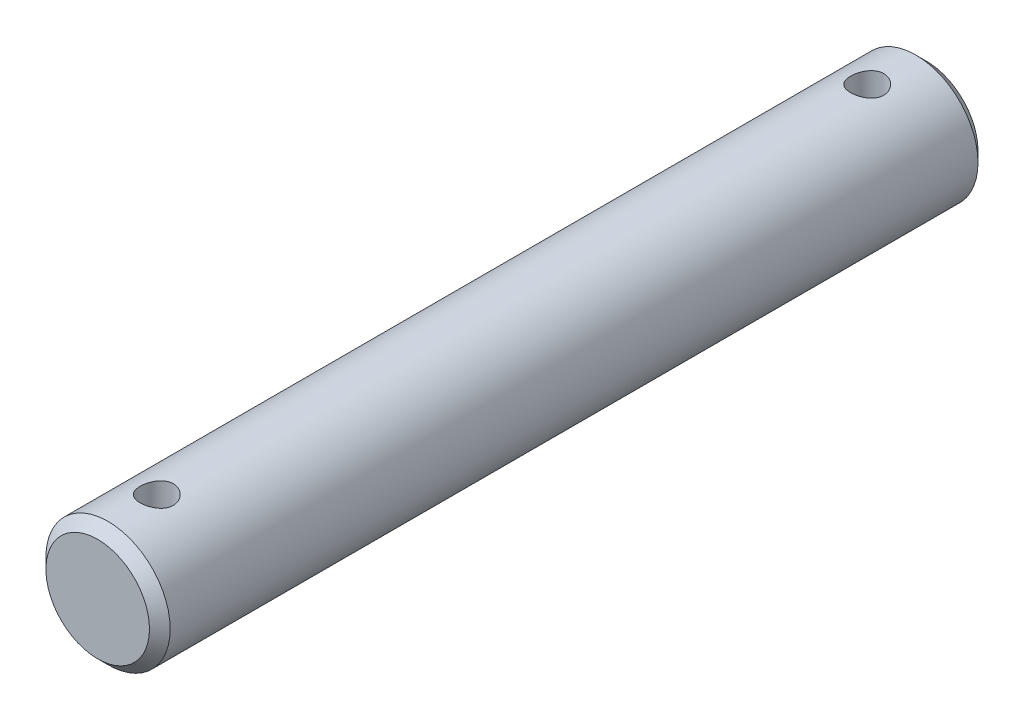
ISO-10303-21;
HEADER;
FILE_DESCRIPTION(('STEP AP214'),'2;1');
FILE_NAME('part.step','',(''),(''),'','','');
FILE_SCHEMA(('AUTOMOTIVE_DESIGN { 1 0 10303 214 1 1 1 1 }'));
ENDSEC;
DATA;
#1=APPLICATION_CONTEXT('core data for automotive mechanical design processes');
#2=APPLICATION_PROTOCOL_DEFINITION('international standard','automotive_design',2000,#1);
#3=PRODUCT_CONTEXT('',#1,'mechanical');
#4=PRODUCT('Part','Part','',(#3));
#5=PRODUCT_RELATED_PRODUCT_CATEGORY('part','',(#4));
#6=PRODUCT_DEFINITION_FORMATION('','',#4);
#7=PRODUCT_DEFINITION_CONTEXT('part definition',#1,'design');
#8=PRODUCT_DEFINITION('design','',#6,#7);
#9=PRODUCT_DEFINITION_SHAPE('','',#8);
#10=(LENGTH_UNIT() NAMED_UNIT(*) SI_UNIT(.MILLI.,.METRE.));
#11=(NAMED_UNIT(*) PLANE_ANGLE_UNIT() SI_UNIT($,.RADIAN.));
#12=(NAMED_UNIT(*) SI_UNIT($,.STERADIAN.) SOLID_ANGLE_UNIT());
#13=UNCERTAINTY_MEASURE_WITH_UNIT(LENGTH_MEASURE(1.E-05),#10,'distance_accuracy_value','');
#14=(GEOMETRIC_REPRESENTATION_CONTEXT(3) GLOBAL_UNCERTAINTY_ASSIGNED_CONTEXT((#13)) GLOBAL_UNIT_ASSIGNED_CONTEXT((#10,
#11,#12)) REPRESENTATION_CONTEXT('',''));
#15=CARTESIAN_POINT('',(0.,0.,0.));
#16=DIRECTION('',(0.,0.,1.));
#17=DIRECTION('',(1.,0.,0.));
#18=AXIS2_PLACEMENT_3D('',#15,#16,#17);
#19=CARTESIAN_POINT('',(0.,0.,20.));
#20=DIRECTION('',(0.,0.,-1.));
#21=DIRECTION('',(-1.,0.,0.));
#22=AXIS2_PLACEMENT_3D('',#19,#20,#21);
#23=CYLINDRICAL_SURFACE('',#22,3.);
#24=CARTESIAN_POINT('',(0.,-3.,17.95));
#25=CARTESIAN_POINT('',(0.0441018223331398,-2.9999993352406,17.9499989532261));
#26=CARTESIAN_POINT('',(0.0882148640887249,-2.99901794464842,17.9463409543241));
#27=CARTESIAN_POINT('',(0.175170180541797,-2.99519829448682,17.9318315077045));
#28=CARTESIAN_POINT('',(0.218011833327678,-2.99235914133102,17.9209765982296));
#29=CARTESIAN_POINT('',(0.301156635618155,-2.98513733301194,17.8924513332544));
#30=CARTESIAN_POINT('',(0.341462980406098,-2.98075666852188,17.8747897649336));
#31=CARTESIAN_POINT('',(0.418541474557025,-2.97091479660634,17.8331851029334));
#32=CARTESIAN_POINT('',(0.455313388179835,-2.96545351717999,17.8092415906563));
#33=CARTESIAN_POINT('',(0.525131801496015,-2.95389845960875,17.7551665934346));
#34=CARTESIAN_POINT('',(0.558084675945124,-2.94779387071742,17.7249165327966));
#35=CARTESIAN_POINT('',(0.61851485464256,-2.93570963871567,17.6593406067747));
#36=CARTESIAN_POINT('',(0.645991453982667,-2.92973001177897,17.6240140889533));
#37=CARTESIAN_POINT('',(0.69514563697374,-2.91846214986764,17.5485407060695));
#38=CARTESIAN_POINT('',(0.716715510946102,-2.91318755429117,17.5083214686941));
#39=CARTESIAN_POINT('',(0.75275019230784,-2.90408590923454,17.4246639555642));
#40=CARTESIAN_POINT('',(0.767216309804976,-2.9002585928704,17.3812262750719));
#41=CARTESIAN_POINT('',(0.788307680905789,-2.89459646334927,17.2934017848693));
#42=CARTESIAN_POINT('',(0.795102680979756,-2.89271859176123,17.2490585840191));
#43=CARTESIAN_POINT('',(0.801188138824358,-2.89103932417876,17.1598249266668));
#44=CARTESIAN_POINT('',(0.800479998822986,-2.89123754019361,17.1149345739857));
#45=CARTESIAN_POINT('',(0.791714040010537,-2.89364951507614,17.027205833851));
#46=CARTESIAN_POINT('',(0.783861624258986,-2.89580694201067,16.9843451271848));
#47=CARTESIAN_POINT('',(0.761358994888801,-2.90180405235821,16.9005726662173));
#48=CARTESIAN_POINT('',(0.746708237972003,-2.90564387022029,16.8596610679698));
#49=CARTESIAN_POINT('',(0.710857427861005,-2.91462264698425,16.7804127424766));
#50=CARTESIAN_POINT('',(0.689585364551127,-2.91977577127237,16.7421102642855));
#51=CARTESIAN_POINT('',(0.641146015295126,-2.93079291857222,16.6695463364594));
#52=CARTESIAN_POINT('',(0.613977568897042,-2.93665708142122,16.6352856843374));
#53=CARTESIAN_POINT('',(0.553466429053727,-2.94867004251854,16.5706044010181));
#54=CARTESIAN_POINT('',(0.519951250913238,-2.95482188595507,16.540345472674));
#55=CARTESIAN_POINT('',(0.448247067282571,-2.9665455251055,16.4858444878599));
#56=CARTESIAN_POINT('',(0.410057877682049,-2.97211729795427,16.461602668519));
#57=CARTESIAN_POINT('',(0.329839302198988,-2.98208728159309,16.4197528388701));
#58=CARTESIAN_POINT('',(0.287793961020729,-2.98648029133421,16.4021740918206));
#59=CARTESIAN_POINT('',(0.201200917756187,-2.99356017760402,16.3743811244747));
#60=CARTESIAN_POINT('',(0.156653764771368,-2.99624742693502,16.3641652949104));
#61=CARTESIAN_POINT('',(0.0677016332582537,-2.99955663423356,16.3516420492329));
#62=CARTESIAN_POINT('',(0.0233296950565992,-3.00023598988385,16.3491147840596));
#63=CARTESIAN_POINT('',(-0.0652040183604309,-2.99961788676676,16.3514332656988));
#64=CARTESIAN_POINT('',(-0.109365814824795,-2.99832063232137,16.3562782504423));
#65=CARTESIAN_POINT('',(-0.195440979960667,-2.99393214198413,16.373023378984));
#66=CARTESIAN_POINT('',(-0.237379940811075,-2.99087210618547,16.3848008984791));
#67=CARTESIAN_POINT('',(-0.318682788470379,-2.98330517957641,16.4149343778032));
#68=CARTESIAN_POINT('',(-0.358046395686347,-2.97879813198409,16.4332910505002));
#69=CARTESIAN_POINT('',(-0.43393538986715,-2.96870264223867,16.4764695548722));
#70=CARTESIAN_POINT('',(-0.470390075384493,-2.96309474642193,16.5014109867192));
#71=CARTESIAN_POINT('',(-0.53867385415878,-2.95144580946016,16.556900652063));
#72=CARTESIAN_POINT('',(-0.570502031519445,-2.94540468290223,16.5874499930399));
#73=CARTESIAN_POINT('',(-0.62955569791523,-2.93335898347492,16.6543142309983));
#74=CARTESIAN_POINT('',(-0.656626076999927,-2.92736024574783,16.69076742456));
#75=CARTESIAN_POINT('',(-0.704268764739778,-2.91626578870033,16.7678258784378));
#76=CARTESIAN_POINT('',(-0.724841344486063,-2.91117003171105,16.8084309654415));
#77=CARTESIAN_POINT('',(-0.758749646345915,-2.90251707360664,16.8924381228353));
#78=CARTESIAN_POINT('',(-0.772127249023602,-2.89895099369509,16.9358223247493));
#79=CARTESIAN_POINT('',(-0.791364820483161,-2.8937593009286,17.0243357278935));
#80=CARTESIAN_POINT('',(-0.797226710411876,-2.8921331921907,17.0694644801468));
#81=CARTESIAN_POINT('',(-0.801155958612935,-2.89104697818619,17.158597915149));
#82=CARTESIAN_POINT('',(-0.799472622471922,-2.89151759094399,17.2025909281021));
#83=CARTESIAN_POINT('',(-0.788937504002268,-2.89440958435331,17.2896414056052));
#84=CARTESIAN_POINT('',(-0.78008590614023,-2.89683091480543,17.3326988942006));
#85=CARTESIAN_POINT('',(-0.755610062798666,-2.903310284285,17.4163423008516));
#86=CARTESIAN_POINT('',(-0.740038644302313,-2.90735554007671,17.4569447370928));
#87=CARTESIAN_POINT('',(-0.702606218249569,-2.91662727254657,17.5349915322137));
#88=CARTESIAN_POINT('',(-0.680744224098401,-2.92185393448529,17.5724353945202));
#89=CARTESIAN_POINT('',(-0.630595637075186,-2.93309168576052,17.6442921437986));
#90=CARTESIAN_POINT('',(-0.602138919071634,-2.93912133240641,17.6785834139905));
#91=CARTESIAN_POINT('',(-0.539932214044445,-2.95118201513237,17.7419849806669));
#92=CARTESIAN_POINT('',(-0.506180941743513,-2.95721305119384,17.7710940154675));
#93=CARTESIAN_POINT('',(-0.43347199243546,-2.96875124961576,17.8239168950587));
#94=CARTESIAN_POINT('',(-0.394418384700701,-2.97424444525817,17.8475020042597));
#95=CARTESIAN_POINT('',(-0.312755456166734,-2.98393524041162,17.8877349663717));
#96=CARTESIAN_POINT('',(-0.270148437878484,-2.98813367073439,17.9043872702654));
#97=CARTESIAN_POINT('',(-0.189749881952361,-2.99421901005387,17.9281101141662));
#98=CARTESIAN_POINT('',(-0.15230480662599,-2.9963710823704,17.936299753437));
#99=CARTESIAN_POINT('',(-0.07657591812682,-2.99926179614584,17.9472448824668));
#100=CARTESIAN_POINT('',(-0.0382921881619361,-3.00000057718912,17.95000090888));
#101=CARTESIAN_POINT('',(0.,-3.,17.95));
#102=B_SPLINE_CURVE_WITH_KNOTS('',3,(#24,#25,#26,#27,#28,#29,#30,#31,#32,#33,#34,#35,#36,#37,
#38,#39,#40,#41,#42,#43,#44,#45,#46,#47,#48,#49,#50,#51,#52,#53,#54,#55,#56,#57,#58,#59,#60,#61,
#62,#63,#64,#65,#66,#67,#68,#69,#70,#71,#72,#73,#74,#75,#76,#77,#78,#79,#80,#81,#82,#83,#84,#85,
#86,#87,#88,#89,#90,#91,#92,#93,#94,#95,#96,#97,#98,#99,#100,#101),.UNSPECIFIED.,.T.,.F.,(4,2,2,
2,2,2,2,2,2,2,2,2,2,2,2,2,2,2,2,2,2,2,2,2,2,2,2,2,2,2,2,2,2,2,2,2,2,2,4),(0.,0.132165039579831,
0.264393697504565,0.396452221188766,0.528519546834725,0.663339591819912,0.79817697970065,
0.935330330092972,1.07245837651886,1.20648863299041,1.34049384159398,1.4707640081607,
1.6010445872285,1.73279469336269,1.86457075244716,2.00064503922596,2.1367246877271,
2.27339523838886,2.41003590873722,2.54273087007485,2.67541211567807,2.80581414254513,
2.93623030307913,3.06920114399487,3.20219827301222,3.33894598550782,3.47568799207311,
3.611625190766,3.74752763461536,3.87897336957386,4.0104157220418,4.14084306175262,
4.27129086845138,4.40557735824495,4.53989649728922,4.67708900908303,4.81419330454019,
4.92895927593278,5.04371391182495),.UNSPECIFIED.);
#103=CARTESIAN_POINT('',(0.,-3.,17.95));
#104=VERTEX_POINT('',#103);
#105=EDGE_CURVE('E10',#104,#104,#102,.T.);
#106=ORIENTED_EDGE('',*,*,#105,.T.);
#107=EDGE_LOOP('',(#106));
#108=FACE_BOUND('',#107,.T.);
#109=CARTESIAN_POINT('',(0.,3.00000000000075,17.95));
#110=CARTESIAN_POINT('',(-0.0441018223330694,2.99999933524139,17.9499989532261));
#111=CARTESIAN_POINT('',(-0.0882148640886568,2.99901794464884,17.9463409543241));
#112=CARTESIAN_POINT('',(-0.175170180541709,2.99519829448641,17.9318315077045));
#113=CARTESIAN_POINT('',(-0.218011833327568,2.99235914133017,17.9209765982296));
#114=CARTESIAN_POINT('',(-0.301156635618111,2.98513733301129,17.8924513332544));
#115=CARTESIAN_POINT('',(-0.341462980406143,2.98075666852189,17.8747897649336));
#116=CARTESIAN_POINT('',(-0.418541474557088,2.97091479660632,17.8331851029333));
#117=CARTESIAN_POINT('',(-0.455313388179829,2.96545351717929,17.8092415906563));
#118=CARTESIAN_POINT('',(-0.525131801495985,2.95389845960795,17.7551665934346));
#119=CARTESIAN_POINT('',(-0.558084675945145,2.9477938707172,17.7249165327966));
#120=CARTESIAN_POINT('',(-0.618514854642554,2.93570963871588,17.6593406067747));
#121=CARTESIAN_POINT('',(-0.645991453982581,2.92973001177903,17.6240140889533));
#122=CARTESIAN_POINT('',(-0.695145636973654,2.91846214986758,17.5485407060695));
#123=CARTESIAN_POINT('',(-0.716715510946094,2.91318755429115,17.5083214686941));
#124=CARTESIAN_POINT('',(-0.752750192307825,2.90408590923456,17.4246639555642));
#125=CARTESIAN_POINT('',(-0.767216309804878,2.9002585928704,17.3812262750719));
#126=CARTESIAN_POINT('',(-0.788307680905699,2.89459646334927,17.2934017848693));
#127=CARTESIAN_POINT('',(-0.795102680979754,2.89271859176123,17.2490585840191));
#128=CARTESIAN_POINT('',(-0.801188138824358,2.89103932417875,17.1598249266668));
#129=CARTESIAN_POINT('',(-0.800479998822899,2.89123754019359,17.1149345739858));
#130=CARTESIAN_POINT('',(-0.791714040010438,2.89364951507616,17.027205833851));
#131=CARTESIAN_POINT('',(-0.78386162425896,2.89580694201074,16.9843451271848));
#132=CARTESIAN_POINT('',(-0.761358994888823,2.90180405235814,16.9005726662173));
#133=CARTESIAN_POINT('',(-0.746708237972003,2.90564387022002,16.8596610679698));
#134=CARTESIAN_POINT('',(-0.710857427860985,2.91462264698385,16.7804127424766));
#135=CARTESIAN_POINT('',(-0.689585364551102,2.91977577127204,16.7421102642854));
#136=CARTESIAN_POINT('',(-0.641146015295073,2.93079291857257,16.6695463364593));
#137=CARTESIAN_POINT('',(-0.613977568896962,2.93665708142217,16.6352856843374));
#138=CARTESIAN_POINT('',(-0.553466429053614,2.94867004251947,16.5706044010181));
#139=CARTESIAN_POINT('',(-0.519951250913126,2.95482188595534,16.540345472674));
#140=CARTESIAN_POINT('',(-0.448247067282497,2.96654552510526,16.4858444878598));
#141=CARTESIAN_POINT('',(-0.41005787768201,2.9721172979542,16.461602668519));
#142=CARTESIAN_POINT('',(-0.329839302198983,2.98208728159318,16.4197528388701));
#143=CARTESIAN_POINT('',(-0.287793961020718,2.98648029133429,16.4021740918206));
#144=CARTESIAN_POINT('',(-0.201200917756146,2.99356017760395,16.3743811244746));
#145=CARTESIAN_POINT('',(-0.156653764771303,2.9962474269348,16.3641652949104));
#146=CARTESIAN_POINT('',(-0.0677016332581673,2.99955663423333,16.3516420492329));
#147=CARTESIAN_POINT('',(-0.0233296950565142,3.00023598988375,16.3491147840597));
#148=CARTESIAN_POINT('',(0.0652040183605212,2.99961788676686,16.3514332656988));
#149=CARTESIAN_POINT('',(0.109365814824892,2.99832063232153,16.3562782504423));
#150=CARTESIAN_POINT('',(0.195440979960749,2.99393214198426,16.373023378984));
#151=CARTESIAN_POINT('',(0.237379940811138,2.99087210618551,16.3848008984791));
#152=CARTESIAN_POINT('',(0.318682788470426,2.98330517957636,16.4149343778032));
#153=CARTESIAN_POINT('',(0.3580463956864,2.97879813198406,16.4332910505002));
#154=CARTESIAN_POINT('',(0.433935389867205,2.9687026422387,16.4764695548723));
#155=CARTESIAN_POINT('',(0.470390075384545,2.96309474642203,16.5014109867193));
#156=CARTESIAN_POINT('',(0.538673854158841,2.95144580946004,16.5569006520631));
#157=CARTESIAN_POINT('',(0.570502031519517,2.94540468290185,16.5874499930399));
#158=CARTESIAN_POINT('',(0.629555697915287,2.93335898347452,16.6543142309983));
#159=CARTESIAN_POINT('',(0.656626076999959,2.92736024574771,16.6907674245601));
#160=CARTESIAN_POINT('',(0.704268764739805,2.91626578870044,16.7678258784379));
#161=CARTESIAN_POINT('',(0.724841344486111,2.91117003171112,16.8084309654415));
#162=CARTESIAN_POINT('',(0.758749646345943,2.90251707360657,16.8924381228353));
#163=CARTESIAN_POINT('',(0.772127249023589,2.89895099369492,16.9358223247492));
#164=CARTESIAN_POINT('',(0.791364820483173,2.89375930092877,17.0243357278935));
#165=CARTESIAN_POINT('',(0.797226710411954,2.8921331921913,17.0694644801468));
#166=CARTESIAN_POINT('',(0.801155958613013,2.89104697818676,17.158597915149));
#167=CARTESIAN_POINT('',(0.79947262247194,2.89151759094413,17.2025909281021));
#168=CARTESIAN_POINT('',(0.788937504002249,2.89440958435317,17.2896414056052));
#169=CARTESIAN_POINT('',(0.780085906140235,2.89683091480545,17.3326988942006));
#170=CARTESIAN_POINT('',(0.755610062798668,2.90331028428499,17.4163423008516));
#171=CARTESIAN_POINT('',(0.740038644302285,2.90735554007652,17.4569447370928));
#172=CARTESIAN_POINT('',(0.702606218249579,2.91662727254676,17.5349915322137));
#173=CARTESIAN_POINT('',(0.680744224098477,2.92185393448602,17.5724353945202));
#174=CARTESIAN_POINT('',(0.630595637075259,2.93309168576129,17.6442921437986));
#175=CARTESIAN_POINT('',(0.602138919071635,2.93912133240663,17.6785834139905));
#176=CARTESIAN_POINT('',(0.539932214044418,2.95118201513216,17.7419849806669));
#177=CARTESIAN_POINT('',(0.506180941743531,2.95721305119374,17.7710940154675));
#178=CARTESIAN_POINT('',(0.433471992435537,2.96875124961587,17.8239168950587));
#179=CARTESIAN_POINT('',(0.39441838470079,2.97424444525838,17.8475020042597));
#180=CARTESIAN_POINT('',(0.312755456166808,2.9839352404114,17.8877349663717));
#181=CARTESIAN_POINT('',(0.270148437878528,2.98813367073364,17.9043872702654));
#182=CARTESIAN_POINT('',(0.189749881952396,2.99421901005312,17.9281101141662));
#183=CARTESIAN_POINT('',(0.152304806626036,2.99637108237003,17.936299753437));
#184=CARTESIAN_POINT('',(0.0765759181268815,2.9992617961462,17.9472448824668));
#185=CARTESIAN_POINT('',(0.0382921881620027,3.00000057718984,17.95000090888));
#186=CARTESIAN_POINT('',(0.,3.00000000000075,17.95));
#187=B_SPLINE_CURVE_WITH_KNOTS('',3,(#109,#110,#111,#112,#113,#114,#115,#116,#117,#118,#119,
#120,#121,#122,#123,#124,#125,#126,#127,#128,#129,#130,#131,#132,#133,#134,#135,#136,#137,#138,
#139,#140,#141,#142,#143,#144,#145,#146,#147,#148,#149,#150,#151,#152,#153,#154,#155,#156,#157,
#158,#159,#160,#161,#162,#163,#164,#165,#166,#167,#168,#169,#170,#171,#172,#173,#174,#175,#176,
#177,#178,#179,#180,#181,#182,#183,#184,#185,#186),.UNSPECIFIED.,.T.,.F.,(4,2,2,2,2,2,2,2,2,2,2,
2,2,2,2,2,2,2,2,2,2,2,2,2,2,2,2,2,2,2,2,2,2,2,2,2,2,2,4),(0.,0.132165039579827,
0.264393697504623,0.39645222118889,0.528519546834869,0.663339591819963,0.798176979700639,
0.935330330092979,1.07245837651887,1.20648863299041,1.340493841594,1.47076400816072,
1.60104458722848,1.73279469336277,1.86457075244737,2.00064503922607,2.13672468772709,
2.27339523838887,2.41003590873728,2.54273087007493,2.67541211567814,2.80581414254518,
2.93623030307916,3.06920114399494,3.20219827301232,3.33894598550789,3.47568799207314,
3.61162519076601,3.74752763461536,3.87897336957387,4.0104157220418,4.14084306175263,
4.27129086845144,4.40557735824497,4.53989649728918,4.67708900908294,4.81419330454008,
4.92895927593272,5.04371391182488),.UNSPECIFIED.);
#188=CARTESIAN_POINT('',(0.,3.00000000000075,17.95));
#189=VERTEX_POINT('',#188);
#190=EDGE_CURVE('E41',#189,#189,#187,.T.);
#191=ORIENTED_EDGE('',*,*,#190,.T.);
#192=EDGE_LOOP('',(#191));
#193=FACE_BOUND('',#192,.T.);
#194=CARTESIAN_POINT('',(0.,-3.,-16.35));
#195=CARTESIAN_POINT('',(0.0441018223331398,-2.9999993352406,-16.3500010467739));
#196=CARTESIAN_POINT('',(0.0882148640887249,-2.99901794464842,-16.3536590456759));
#197=CARTESIAN_POINT('',(0.175170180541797,-2.99519829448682,-16.3681684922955));
#198=CARTESIAN_POINT('',(0.218011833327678,-2.99235914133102,-16.3790234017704));
#199=CARTESIAN_POINT('',(0.301156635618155,-2.98513733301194,-16.4075486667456));
#200=CARTESIAN_POINT('',(0.341462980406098,-2.98075666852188,-16.4252102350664));
#201=CARTESIAN_POINT('',(0.418541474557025,-2.97091479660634,-16.4668148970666));
#202=CARTESIAN_POINT('',(0.455313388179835,-2.96545351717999,-16.4907584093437));
#203=CARTESIAN_POINT('',(0.525131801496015,-2.95389845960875,-16.5448334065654));
#204=CARTESIAN_POINT('',(0.558084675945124,-2.94779387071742,-16.5750834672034));
#205=CARTESIAN_POINT('',(0.61851485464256,-2.93570963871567,-16.6406593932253));
#206=CARTESIAN_POINT('',(0.645991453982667,-2.92973001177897,-16.6759859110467));
#207=CARTESIAN_POINT('',(0.69514563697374,-2.91846214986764,-16.7514592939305));
#208=CARTESIAN_POINT('',(0.716715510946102,-2.91318755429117,-16.7916785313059));
#209=CARTESIAN_POINT('',(0.75275019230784,-2.90408590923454,-16.8753360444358));
#210=CARTESIAN_POINT('',(0.767216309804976,-2.9002585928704,-16.9187737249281));
#211=CARTESIAN_POINT('',(0.788307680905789,-2.89459646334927,-17.0065982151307));
#212=CARTESIAN_POINT('',(0.795102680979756,-2.89271859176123,-17.0509414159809));
#213=CARTESIAN_POINT('',(0.801188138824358,-2.89103932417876,-17.1401750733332));
#214=CARTESIAN_POINT('',(0.800479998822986,-2.89123754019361,-17.1850654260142));
#215=CARTESIAN_POINT('',(0.791714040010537,-2.89364951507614,-17.2727941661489));
#216=CARTESIAN_POINT('',(0.783861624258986,-2.89580694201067,-17.3156548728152));
#217=CARTESIAN_POINT('',(0.761358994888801,-2.90180405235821,-17.3994273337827));
#218=CARTESIAN_POINT('',(0.746708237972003,-2.90564387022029,-17.4403389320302));
#219=CARTESIAN_POINT('',(0.710857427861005,-2.91462264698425,-17.5195872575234));
#220=CARTESIAN_POINT('',(0.689585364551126,-2.91977577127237,-17.5578897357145));
#221=CARTESIAN_POINT('',(0.641146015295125,-2.93079291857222,-17.6304536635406));
#222=CARTESIAN_POINT('',(0.613977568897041,-2.93665708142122,-17.6647143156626));
#223=CARTESIAN_POINT('',(0.553466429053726,-2.94867004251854,-17.7293955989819));
#224=CARTESIAN_POINT('',(0.519951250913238,-2.95482188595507,-17.759654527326));
#225=CARTESIAN_POINT('',(0.448247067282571,-2.9665455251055,-17.8141555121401));
#226=CARTESIAN_POINT('',(0.410057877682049,-2.97211729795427,-17.838397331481));
#227=CARTESIAN_POINT('',(0.329839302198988,-2.98208728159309,-17.8802471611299));
#228=CARTESIAN_POINT('',(0.287793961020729,-2.98648029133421,-17.8978259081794));
#229=CARTESIAN_POINT('',(0.201200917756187,-2.99356017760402,-17.9256188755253));
#230=CARTESIAN_POINT('',(0.156653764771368,-2.99624742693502,-17.9358347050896));
#231=CARTESIAN_POINT('',(0.0677016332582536,-2.99955663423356,-17.9483579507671));
#232=CARTESIAN_POINT('',(0.0233296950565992,-3.00023598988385,-17.9508852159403));
#233=CARTESIAN_POINT('',(-0.0652040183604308,-2.99961788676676,-17.9485667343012));
#234=CARTESIAN_POINT('',(-0.109365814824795,-2.99832063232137,-17.9437217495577));
#235=CARTESIAN_POINT('',(-0.195440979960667,-2.99393214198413,-17.926976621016));
#236=CARTESIAN_POINT('',(-0.237379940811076,-2.99087210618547,-17.9151991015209));
#237=CARTESIAN_POINT('',(-0.31868278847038,-2.98330517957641,-17.8850656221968));
#238=CARTESIAN_POINT('',(-0.358046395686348,-2.97879813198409,-17.8667089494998));
#239=CARTESIAN_POINT('',(-0.43393538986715,-2.96870264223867,-17.8235304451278));
#240=CARTESIAN_POINT('',(-0.470390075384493,-2.96309474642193,-17.7985890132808));
#241=CARTESIAN_POINT('',(-0.53867385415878,-2.95144580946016,-17.743099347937));
#242=CARTESIAN_POINT('',(-0.570502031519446,-2.94540468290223,-17.7125500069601));
#243=CARTESIAN_POINT('',(-0.629555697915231,-2.93335898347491,-17.6456857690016));
#244=CARTESIAN_POINT('',(-0.656626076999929,-2.92736024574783,-17.60923257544));
#245=CARTESIAN_POINT('',(-0.70426876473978,-2.91626578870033,-17.5321741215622));
#246=CARTESIAN_POINT('',(-0.724841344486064,-2.91117003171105,-17.4915690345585));
#247=CARTESIAN_POINT('',(-0.758749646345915,-2.90251707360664,-17.4075618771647));
#248=CARTESIAN_POINT('',(-0.772127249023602,-2.89895099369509,-17.3641776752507));
#249=CARTESIAN_POINT('',(-0.791364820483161,-2.8937593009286,-17.2756642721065));
#250=CARTESIAN_POINT('',(-0.797226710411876,-2.8921331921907,-17.2305355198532));
#251=CARTESIAN_POINT('',(-0.801155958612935,-2.89104697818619,-17.141402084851));
#252=CARTESIAN_POINT('',(-0.799472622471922,-2.89151759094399,-17.0974090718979));
#253=CARTESIAN_POINT('',(-0.788937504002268,-2.89440958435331,-17.0103585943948));
#254=CARTESIAN_POINT('',(-0.78008590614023,-2.89683091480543,-16.9673011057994));
#255=CARTESIAN_POINT('',(-0.755610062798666,-2.903310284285,-16.8836576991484));
#256=CARTESIAN_POINT('',(-0.740038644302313,-2.90735554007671,-16.8430552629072));
#257=CARTESIAN_POINT('',(-0.702606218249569,-2.91662727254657,-16.7650084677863));
#258=CARTESIAN_POINT('',(-0.680744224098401,-2.92185393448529,-16.7275646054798));
#259=CARTESIAN_POINT('',(-0.630595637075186,-2.93309168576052,-16.6557078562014));
#260=CARTESIAN_POINT('',(-0.602138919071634,-2.93912133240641,-16.6214165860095));
#261=CARTESIAN_POINT('',(-0.539932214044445,-2.95118201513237,-16.5580150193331));
#262=CARTESIAN_POINT('',(-0.506180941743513,-2.95721305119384,-16.5289059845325));
#263=CARTESIAN_POINT('',(-0.43347199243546,-2.96875124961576,-16.4760831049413));
#264=CARTESIAN_POINT('',(-0.394418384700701,-2.97424444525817,-16.4524979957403));
#265=CARTESIAN_POINT('',(-0.312755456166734,-2.98393524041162,-16.4122650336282));
#266=CARTESIAN_POINT('',(-0.270148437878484,-2.98813367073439,-16.3956127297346));
#267=CARTESIAN_POINT('',(-0.189749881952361,-2.99421901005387,-16.3718898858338));
#268=CARTESIAN_POINT('',(-0.15230480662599,-2.9963710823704,-16.363700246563));
#269=CARTESIAN_POINT('',(-0.07657591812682,-2.99926179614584,-16.3527551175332));
#270=CARTESIAN_POINT('',(-0.0382921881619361,-3.00000057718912,-16.34999909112));
#271=CARTESIAN_POINT('',(0.,-3.,-16.35));
#272=B_SPLINE_CURVE_WITH_KNOTS('',3,(#194,#195,#196,#197,#198,#199,#200,#201,#202,#203,#204,
#205,#206,#207,#208,#209,#210,#211,#212,#213,#214,#215,#216,#217,#218,#219,#220,#221,#222,#223,
#224,#225,#226,#227,#228,#229,#230,#231,#232,#233,#234,#235,#236,#237,#238,#239,#240,#241,#242,
#243,#244,#245,#246,#247,#248,#249,#250,#251,#252,#253,#254,#255,#256,#257,#258,#259,#260,#261,
#262,#263,#264,#265,#266,#267,#268,#269,#270,#271),.UNSPECIFIED.,.T.,.F.,(4,2,2,2,2,2,2,2,2,2,2,
2,2,2,2,2,2,2,2,2,2,2,2,2,2,2,2,2,2,2,2,2,2,2,2,2,2,2,4),(0.,0.132165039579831,
0.264393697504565,0.396452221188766,0.528519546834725,0.663339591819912,0.79817697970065,
0.935330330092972,1.07245837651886,1.20648863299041,1.34049384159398,1.4707640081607,
1.6010445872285,1.7327946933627,1.86457075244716,2.00064503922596,2.1367246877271,
2.27339523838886,2.41003590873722,2.54273087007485,2.67541211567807,2.80581414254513,
2.93623030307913,3.06920114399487,3.20219827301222,3.33894598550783,3.47568799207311,
3.611625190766,3.74752763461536,3.87897336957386,4.0104157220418,4.14084306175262,
4.27129086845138,4.40557735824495,4.53989649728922,4.67708900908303,4.81419330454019,
4.92895927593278,5.04371391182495),.UNSPECIFIED.);
#273=CARTESIAN_POINT('',(0.,-3.,-16.35));
#274=VERTEX_POINT('',#273);
#275=EDGE_CURVE('E45',#274,#274,#272,.T.);
#276=ORIENTED_EDGE('',*,*,#275,.T.);
#277=EDGE_LOOP('',(#276));
#278=FACE_BOUND('',#277,.T.);
#279=CARTESIAN_POINT('',(0.,3.00000000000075,-16.35));
#280=CARTESIAN_POINT('',(-0.0441018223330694,2.99999933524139,-16.3500010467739));
#281=CARTESIAN_POINT('',(-0.0882148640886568,2.99901794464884,-16.3536590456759));
#282=CARTESIAN_POINT('',(-0.175170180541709,2.99519829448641,-16.3681684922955));
#283=CARTESIAN_POINT('',(-0.218011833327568,2.99235914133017,-16.3790234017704));
#284=CARTESIAN_POINT('',(-0.301156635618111,2.98513733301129,-16.4075486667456));
#285=CARTESIAN_POINT('',(-0.341462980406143,2.98075666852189,-16.4252102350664));
#286=CARTESIAN_POINT('',(-0.418541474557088,2.97091479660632,-16.4668148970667));
#287=CARTESIAN_POINT('',(-0.455313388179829,2.96545351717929,-16.4907584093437));
#288=CARTESIAN_POINT('',(-0.525131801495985,2.95389845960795,-16.5448334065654));
#289=CARTESIAN_POINT('',(-0.558084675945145,2.9477938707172,-16.5750834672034));
#290=CARTESIAN_POINT('',(-0.618514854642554,2.93570963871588,-16.6406593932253));
#291=CARTESIAN_POINT('',(-0.645991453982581,2.92973001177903,-16.6759859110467));
#292=CARTESIAN_POINT('',(-0.695145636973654,2.91846214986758,-16.7514592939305));
#293=CARTESIAN_POINT('',(-0.716715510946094,2.91318755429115,-16.7916785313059));
#294=CARTESIAN_POINT('',(-0.752750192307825,2.90408590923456,-16.8753360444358));
#295=CARTESIAN_POINT('',(-0.767216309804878,2.9002585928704,-16.9187737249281));
#296=CARTESIAN_POINT('',(-0.788307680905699,2.89459646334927,-17.0065982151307));
#297=CARTESIAN_POINT('',(-0.795102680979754,2.89271859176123,-17.0509414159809));
#298=CARTESIAN_POINT('',(-0.801188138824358,2.89103932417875,-17.1401750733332));
#299=CARTESIAN_POINT('',(-0.800479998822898,2.89123754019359,-17.1850654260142));
#300=CARTESIAN_POINT('',(-0.791714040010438,2.89364951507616,-17.2727941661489));
#301=CARTESIAN_POINT('',(-0.78386162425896,2.89580694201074,-17.3156548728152));
#302=CARTESIAN_POINT('',(-0.761358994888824,2.90180405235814,-17.3994273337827));
#303=CARTESIAN_POINT('',(-0.746708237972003,2.90564387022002,-17.4403389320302));
#304=CARTESIAN_POINT('',(-0.710857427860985,2.91462264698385,-17.5195872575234));
#305=CARTESIAN_POINT('',(-0.689585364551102,2.91977577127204,-17.5578897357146));
#306=CARTESIAN_POINT('',(-0.641146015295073,2.93079291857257,-17.6304536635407));
#307=CARTESIAN_POINT('',(-0.613977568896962,2.93665708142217,-17.6647143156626));
#308=CARTESIAN_POINT('',(-0.553466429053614,2.94867004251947,-17.7293955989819));
#309=CARTESIAN_POINT('',(-0.519951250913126,2.95482188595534,-17.759654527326));
#310=CARTESIAN_POINT('',(-0.448247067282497,2.96654552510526,-17.8141555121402));
#311=CARTESIAN_POINT('',(-0.41005787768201,2.9721172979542,-17.838397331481));
#312=CARTESIAN_POINT('',(-0.329839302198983,2.98208728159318,-17.8802471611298));
#313=CARTESIAN_POINT('',(-0.287793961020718,2.98648029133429,-17.8978259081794));
#314=CARTESIAN_POINT('',(-0.201200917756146,2.99356017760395,-17.9256188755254));
#315=CARTESIAN_POINT('',(-0.156653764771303,2.9962474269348,-17.9358347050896));
#316=CARTESIAN_POINT('',(-0.0677016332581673,2.99955663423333,-17.9483579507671));
#317=CARTESIAN_POINT('',(-0.0233296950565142,3.00023598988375,-17.9508852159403));
#318=CARTESIAN_POINT('',(0.0652040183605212,2.99961788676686,-17.9485667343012));
#319=CARTESIAN_POINT('',(0.109365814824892,2.99832063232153,-17.9437217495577));
#320=CARTESIAN_POINT('',(0.195440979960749,2.99393214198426,-17.926976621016));
#321=CARTESIAN_POINT('',(0.237379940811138,2.99087210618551,-17.9151991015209));
#322=CARTESIAN_POINT('',(0.318682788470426,2.98330517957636,-17.8850656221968));
#323=CARTESIAN_POINT('',(0.3580463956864,2.97879813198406,-17.8667089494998));
#324=CARTESIAN_POINT('',(0.433935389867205,2.9687026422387,-17.8235304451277));
#325=CARTESIAN_POINT('',(0.470390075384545,2.96309474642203,-17.7985890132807));
#326=CARTESIAN_POINT('',(0.538673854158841,2.95144580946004,-17.7430993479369));
#327=CARTESIAN_POINT('',(0.570502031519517,2.94540468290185,-17.7125500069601));
#328=CARTESIAN_POINT('',(0.629555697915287,2.93335898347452,-17.6456857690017));
#329=CARTESIAN_POINT('',(0.656626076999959,2.92736024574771,-17.6092325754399));
#330=CARTESIAN_POINT('',(0.704268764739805,2.91626578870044,-17.5321741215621));
#331=CARTESIAN_POINT('',(0.724841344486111,2.91117003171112,-17.4915690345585));
#332=CARTESIAN_POINT('',(0.758749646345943,2.90251707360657,-17.4075618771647));
#333=CARTESIAN_POINT('',(0.772127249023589,2.89895099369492,-17.3641776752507));
#334=CARTESIAN_POINT('',(0.791364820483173,2.89375930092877,-17.2756642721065));
#335=CARTESIAN_POINT('',(0.797226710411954,2.8921331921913,-17.2305355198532));
#336=CARTESIAN_POINT('',(0.801155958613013,2.89104697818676,-17.141402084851));
#337=CARTESIAN_POINT('',(0.79947262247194,2.89151759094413,-17.0974090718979));
#338=CARTESIAN_POINT('',(0.788937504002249,2.89440958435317,-17.0103585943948));
#339=CARTESIAN_POINT('',(0.780085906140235,2.89683091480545,-16.9673011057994));
#340=CARTESIAN_POINT('',(0.755610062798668,2.90331028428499,-16.8836576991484));
#341=CARTESIAN_POINT('',(0.740038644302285,2.90735554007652,-16.8430552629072));
#342=CARTESIAN_POINT('',(0.702606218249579,2.91662727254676,-16.7650084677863));
#343=CARTESIAN_POINT('',(0.680744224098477,2.92185393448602,-16.7275646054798));
#344=CARTESIAN_POINT('',(0.630595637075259,2.93309168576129,-16.6557078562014));
#345=CARTESIAN_POINT('',(0.602138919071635,2.93912133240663,-16.6214165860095));
#346=CARTESIAN_POINT('',(0.539932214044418,2.95118201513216,-16.5580150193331));
#347=CARTESIAN_POINT('',(0.506180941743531,2.95721305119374,-16.5289059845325));
#348=CARTESIAN_POINT('',(0.433471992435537,2.96875124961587,-16.4760831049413));
#349=CARTESIAN_POINT('',(0.39441838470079,2.97424444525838,-16.4524979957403));
#350=CARTESIAN_POINT('',(0.312755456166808,2.9839352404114,-16.4122650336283));
#351=CARTESIAN_POINT('',(0.270148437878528,2.98813367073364,-16.3956127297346));
#352=CARTESIAN_POINT('',(0.189749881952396,2.99421901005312,-16.3718898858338));
#353=CARTESIAN_POINT('',(0.152304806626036,2.99637108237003,-16.363700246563));
#354=CARTESIAN_POINT('',(0.0765759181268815,2.9992617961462,-16.3527551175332));
#355=CARTESIAN_POINT('',(0.0382921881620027,3.00000057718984,-16.34999909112));
#356=CARTESIAN_POINT('',(0.,3.00000000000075,-16.35));
#357=B_SPLINE_CURVE_WITH_KNOTS('',3,(#279,#280,#281,#282,#283,#284,#285,#286,#287,#288,#289,
#290,#291,#292,#293,#294,#295,#296,#297,#298,#299,#300,#301,#302,#303,#304,#305,#306,#307,#308,
#309,#310,#311,#312,#313,#314,#315,#316,#317,#318,#319,#320,#321,#322,#323,#324,#325,#326,#327,
#328,#329,#330,#331,#332,#333,#334,#335,#336,#337,#338,#339,#340,#341,#342,#343,#344,#345,#346,
#347,#348,#349,#350,#351,#352,#353,#354,#355,#356),.UNSPECIFIED.,.T.,.F.,(4,2,2,2,2,2,2,2,2,2,2,
2,2,2,2,2,2,2,2,2,2,2,2,2,2,2,2,2,2,2,2,2,2,2,2,2,2,2,4),(0.,0.132165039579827,
0.264393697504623,0.39645222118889,0.528519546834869,0.663339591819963,0.798176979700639,
0.935330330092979,1.07245837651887,1.20648863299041,1.340493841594,1.47076400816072,
1.60104458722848,1.73279469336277,1.86457075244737,2.00064503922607,2.13672468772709,
2.27339523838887,2.41003590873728,2.54273087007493,2.67541211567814,2.80581414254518,
2.93623030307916,3.06920114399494,3.20219827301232,3.33894598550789,3.47568799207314,
3.61162519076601,3.74752763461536,3.87897336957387,4.0104157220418,4.14084306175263,
4.27129086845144,4.40557735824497,4.53989649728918,4.67708900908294,4.81419330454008,
4.92895927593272,5.04371391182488),.UNSPECIFIED.);
#358=CARTESIAN_POINT('',(0.,3.00000000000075,-16.35));
#359=VERTEX_POINT('',#358);
#360=EDGE_CURVE('E49',#359,#359,#357,.T.);
#361=ORIENTED_EDGE('',*,*,#360,.T.);
#362=EDGE_LOOP('',(#361));
#363=FACE_BOUND('',#362,.T.);
#364=CARTESIAN_POINT('',(0.,0.,-19.5));
#365=DIRECTION('',(0.,0.,1.));
#366=DIRECTION('',(1.,0.,0.));
#367=AXIS2_PLACEMENT_3D('',#364,#365,#366);
#368=CIRCLE('',#367,3.);
#369=CARTESIAN_POINT('',(3.00000000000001,0.,-19.5));
#370=VERTEX_POINT('',#369);
#371=EDGE_CURVE('E81',#370,#370,#368,.T.);
#372=ORIENTED_EDGE('',*,*,#371,.T.);
#373=EDGE_LOOP('',(#372));
#374=FACE_BOUND('',#373,.T.);
#375=CARTESIAN_POINT('',(0.,0.,19.5));
#376=DIRECTION('',(0.,0.,1.));
#377=DIRECTION('',(1.,0.,0.));
#378=AXIS2_PLACEMENT_3D('',#375,#376,#377);
#379=CIRCLE('',#378,3.);
#380=CARTESIAN_POINT('',(3.00000000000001,0.,19.5));
#381=VERTEX_POINT('',#380);
#382=EDGE_CURVE('E84',#381,#381,#379,.F.);
#383=ORIENTED_EDGE('',*,*,#382,.T.);
#384=EDGE_LOOP('',(#383));
#385=FACE_BOUND('',#384,.T.);
#386=ADVANCED_FACE('F30',(#108,#193,#278,#363,#374,#385),#23,.T.);
#387=CARTESIAN_POINT('',(0.,0.,20.));
#388=DIRECTION('',(0.,0.,1.));
#389=DIRECTION('',(1.,0.,0.));
#390=AXIS2_PLACEMENT_3D('',#387,#388,#389);
#391=PLANE('',#390);
#392=CARTESIAN_POINT('',(0.,0.,20.));
#393=DIRECTION('',(0.,0.,1.));
#394=DIRECTION('',(1.,0.,0.));
#395=AXIS2_PLACEMENT_3D('',#392,#393,#394);
#396=CIRCLE('',#395,2.5);
#397=CARTESIAN_POINT('',(2.50000000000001,0.,20.));
#398=VERTEX_POINT('',#397);
#399=EDGE_CURVE('E75',#398,#398,#396,.T.);
#400=ORIENTED_EDGE('',*,*,#399,.T.);
#401=EDGE_LOOP('',(#400));
#402=FACE_BOUND('',#401,.T.);
#403=ADVANCED_FACE('F69',(#402),#391,.T.);
#404=CARTESIAN_POINT('',(0.,0.,-20.));
#405=DIRECTION('',(0.,0.,1.));
#406=DIRECTION('',(1.,0.,0.));
#407=AXIS2_PLACEMENT_3D('',#404,#405,#406);
#408=PLANE('',#407);
#409=CARTESIAN_POINT('',(0.,0.,-20.));
#410=DIRECTION('',(0.,0.,1.));
#411=DIRECTION('',(1.,0.,0.));
#412=AXIS2_PLACEMENT_3D('',#409,#410,#411);
#413=CIRCLE('',#412,2.49999999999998);
#414=CARTESIAN_POINT('',(2.49999999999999,0.,-20.));
#415=VERTEX_POINT('',#414);
#416=EDGE_CURVE('E78',#415,#415,#413,.F.);
#417=ORIENTED_EDGE('',*,*,#416,.T.);
#418=EDGE_LOOP('',(#417));
#419=FACE_BOUND('',#418,.T.);
#420=ADVANCED_FACE('F95',(#419),#408,.F.);
#421=CARTESIAN_POINT('',(0.,0.,-19.5));
#422=DIRECTION('',(0.,0.,1.));
#423=DIRECTION('',(1.,0.,0.));
#424=AXIS2_PLACEMENT_3D('',#421,#422,#423);
#425=CONICAL_SURFACE('',#424,3.,0.785398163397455);
#426=ORIENTED_EDGE('',*,*,#416,.F.);
#427=EDGE_LOOP('',(#426));
#428=FACE_BOUND('',#427,.T.);
#429=ORIENTED_EDGE('',*,*,#371,.F.);
#430=EDGE_LOOP('',(#429));
#431=FACE_BOUND('',#430,.T.);
#432=ADVANCED_FACE('F91',(#428,#431),#425,.T.);
#433=CARTESIAN_POINT('',(0.,0.,20.));
#434=DIRECTION('',(0.,0.,-1.));
#435=DIRECTION('',(-1.,0.,0.));
#436=AXIS2_PLACEMENT_3D('',#433,#434,#435);
#437=CONICAL_SURFACE('',#436,2.5,0.785398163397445);
#438=ORIENTED_EDGE('',*,*,#382,.F.);
#439=EDGE_LOOP('',(#438));
#440=FACE_BOUND('',#439,.T.);
#441=ORIENTED_EDGE('',*,*,#399,.F.);
#442=EDGE_LOOP('',(#441));
#443=FACE_BOUND('',#442,.T.);
#444=ADVANCED_FACE('F32',(#440,#443),#437,.T.);
#445=CARTESIAN_POINT('',(0.,-3.,-17.15));
#446=DIRECTION('',(0.,1.,0.));
#447=DIRECTION('',(0.,0.,1.));
#448=AXIS2_PLACEMENT_3D('',#445,#446,#447);
#449=CYLINDRICAL_SURFACE('',#448,0.799999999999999);
#450=ORIENTED_EDGE('',*,*,#360,.F.);
#451=EDGE_LOOP('',(#450));
#452=FACE_BOUND('',#451,.T.);
#453=ORIENTED_EDGE('',*,*,#275,.F.);
#454=EDGE_LOOP('',(#453));
#455=FACE_BOUND('',#454,.T.);
#456=ADVANCED_FACE('F62',(#452,#455),#449,.F.);
#457=CARTESIAN_POINT('',(0.,-3.,17.15));
#458=DIRECTION('',(0.,1.,0.));
#459=DIRECTION('',(0.,0.,1.));
#460=AXIS2_PLACEMENT_3D('',#457,#458,#459);
#461=CYLINDRICAL_SURFACE('',#460,0.799999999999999);
#462=ORIENTED_EDGE('',*,*,#190,.F.);
#463=EDGE_LOOP('',(#462));
#464=FACE_BOUND('',#463,.T.);
#465=ORIENTED_EDGE('',*,*,#105,.F.);
#466=EDGE_LOOP('',(#465));
#467=FACE_BOUND('',#466,.T.);
#468=ADVANCED_FACE('F59',(#464,#467),#461,.F.);
#469=CLOSED_SHELL('',(#386,#403,#420,#432,#444,#456,#468));
#470=MANIFOLD_SOLID_BREP('B2',#469);
#471=ADVANCED_BREP_SHAPE_REPRESENTATION('',(#18,#470),#14);
#472=SHAPE_DEFINITION_REPRESENTATION(#9,#471);
ENDSEC;
END-ISO-10303-21;
